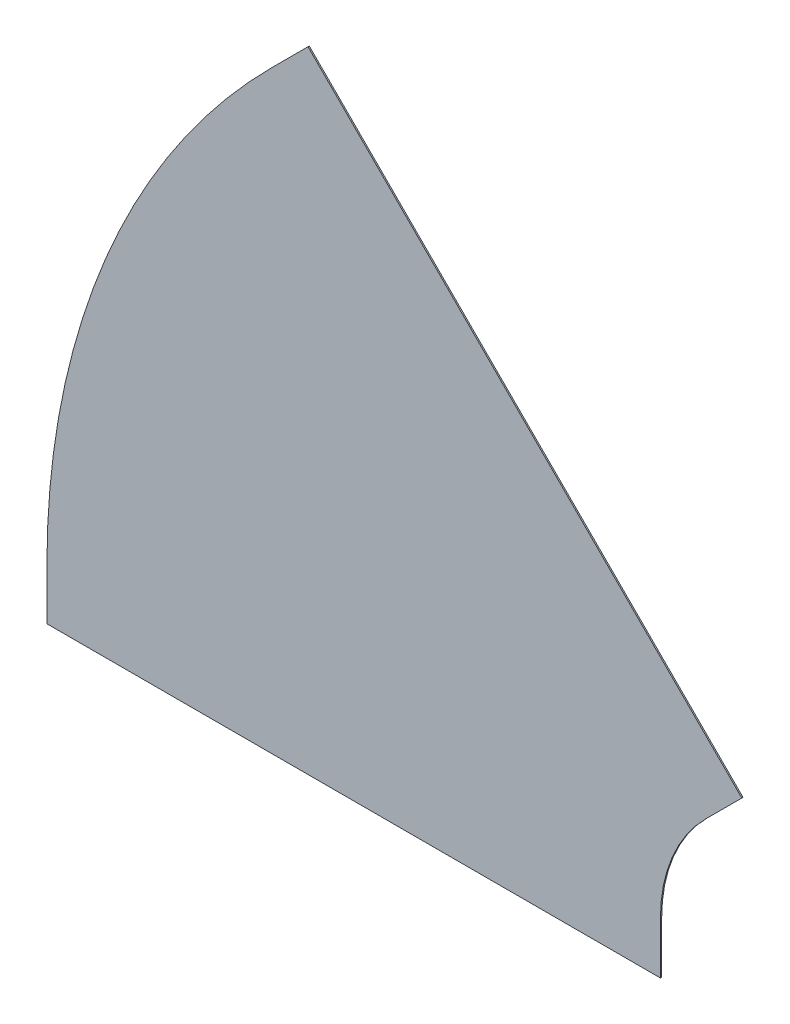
ISO-10303-21;
HEADER;
FILE_DESCRIPTION(('STEP AP214'),'2;1');
FILE_NAME('part.step','',(''),(''),'','','');
FILE_SCHEMA(('AUTOMOTIVE_DESIGN { 1 0 10303 214 1 1 1 1 }'));
ENDSEC;
DATA;
#1=APPLICATION_CONTEXT('core data for automotive mechanical design processes');
#2=APPLICATION_PROTOCOL_DEFINITION('international standard','automotive_design',2000,#1);
#3=PRODUCT_CONTEXT('',#1,'mechanical');
#4=PRODUCT('Part','Part','',(#3));
#5=PRODUCT_RELATED_PRODUCT_CATEGORY('part','',(#4));
#6=PRODUCT_DEFINITION_FORMATION('','',#4);
#7=PRODUCT_DEFINITION_CONTEXT('part definition',#1,'design');
#8=PRODUCT_DEFINITION('design','',#6,#7);
#9=PRODUCT_DEFINITION_SHAPE('','',#8);
#10=(LENGTH_UNIT() NAMED_UNIT(*) SI_UNIT(.MILLI.,.METRE.));
#11=(NAMED_UNIT(*) PLANE_ANGLE_UNIT() SI_UNIT($,.RADIAN.));
#12=(NAMED_UNIT(*) SI_UNIT($,.STERADIAN.) SOLID_ANGLE_UNIT());
#13=UNCERTAINTY_MEASURE_WITH_UNIT(LENGTH_MEASURE(1.E-05),#10,'distance_accuracy_value','');
#14=(GEOMETRIC_REPRESENTATION_CONTEXT(3) GLOBAL_UNCERTAINTY_ASSIGNED_CONTEXT((#13)) GLOBAL_UNIT_ASSIGNED_CONTEXT((#10,
#11,#12)) REPRESENTATION_CONTEXT('',''));
#15=CARTESIAN_POINT('',(0.,0.,0.));
#16=DIRECTION('',(0.,0.,1.));
#17=DIRECTION('',(1.,0.,0.));
#18=AXIS2_PLACEMENT_3D('',#15,#16,#17);
#19=CARTESIAN_POINT('',(0.,50.,1.21412));
#20=DIRECTION('',(1.,0.,0.));
#21=DIRECTION('',(0.,1.,0.));
#22=AXIS2_PLACEMENT_3D('',#19,#20,#21);
#23=PLANE('',#22);
#24=DIRECTION('',(0.,-1.,0.));
#25=VECTOR('',#24,1.);
#26=CARTESIAN_POINT('',(0.,50.,0.));
#27=LINE('',#26,#25);
#28=CARTESIAN_POINT('',(0.,50.0000000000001,0.));
#29=VERTEX_POINT('',#28);
#30=CARTESIAN_POINT('',(0.,0.,0.));
#31=VERTEX_POINT('',#30);
#32=EDGE_CURVE('E129',#29,#31,#27,.T.);
#33=ORIENTED_EDGE('',*,*,#32,.T.);
#34=DIRECTION('',(0.,0.,-1.));
#35=VECTOR('',#34,1.);
#36=CARTESIAN_POINT('',(0.,0.,1.21412));
#37=LINE('',#36,#35);
#38=CARTESIAN_POINT('',(0.,0.,1.21412));
#39=VERTEX_POINT('',#38);
#40=EDGE_CURVE('E11',#39,#31,#37,.T.);
#41=ORIENTED_EDGE('',*,*,#40,.F.);
#42=DIRECTION('',(0.,-1.,0.));
#43=VECTOR('',#42,1.);
#44=CARTESIAN_POINT('',(0.,50.,1.21412));
#45=LINE('',#44,#43);
#46=CARTESIAN_POINT('',(0.,50.0000000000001,1.21412));
#47=VERTEX_POINT('',#46);
#48=EDGE_CURVE('E143',#47,#39,#45,.T.);
#49=ORIENTED_EDGE('',*,*,#48,.F.);
#50=DIRECTION('',(0.,0.,-1.));
#51=VECTOR('',#50,1.);
#52=CARTESIAN_POINT('',(0.,50.0000000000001,1.21412));
#53=LINE('',#52,#51);
#54=EDGE_CURVE('E125',#47,#29,#53,.T.);
#55=ORIENTED_EDGE('',*,*,#54,.T.);
#56=EDGE_LOOP('',(#33,#41,#49,#55));
#57=FACE_BOUND('',#56,.T.);
#58=ADVANCED_FACE('F33',(#57),#23,.F.);
#59=CARTESIAN_POINT('',(0.,0.,1.21412));
#60=DIRECTION('',(0.,1.,0.));
#61=DIRECTION('',(0.,0.,1.));
#62=AXIS2_PLACEMENT_3D('',#59,#60,#61);
#63=PLANE('',#62);
#64=DIRECTION('',(1.,0.,0.));
#65=VECTOR('',#64,1.);
#66=CARTESIAN_POINT('',(0.,0.,0.));
#67=LINE('',#66,#65);
#68=CARTESIAN_POINT('',(597.572,0.,0.));
#69=VERTEX_POINT('',#68);
#70=EDGE_CURVE('E132',#31,#69,#67,.T.);
#71=ORIENTED_EDGE('',*,*,#70,.T.);
#72=DIRECTION('',(0.,0.,-1.));
#73=VECTOR('',#72,1.);
#74=CARTESIAN_POINT('',(597.572,0.,1.21412));
#75=LINE('',#74,#73);
#76=CARTESIAN_POINT('',(597.572,0.,1.21412));
#77=VERTEX_POINT('',#76);
#78=EDGE_CURVE('E41',#77,#69,#75,.T.);
#79=ORIENTED_EDGE('',*,*,#78,.F.);
#80=DIRECTION('',(1.,0.,0.));
#81=VECTOR('',#80,1.);
#82=CARTESIAN_POINT('',(0.,0.,1.21412));
#83=LINE('',#82,#81);
#84=EDGE_CURVE('E92',#39,#77,#83,.T.);
#85=ORIENTED_EDGE('',*,*,#84,.F.);
#86=ORIENTED_EDGE('',*,*,#40,.T.);
#87=EDGE_LOOP('',(#71,#79,#85,#86));
#88=FACE_BOUND('',#87,.T.);
#89=ADVANCED_FACE('F178',(#88),#63,.F.);
#90=CARTESIAN_POINT('',(597.572,0.,1.21412));
#91=DIRECTION('',(-1.,0.,0.));
#92=DIRECTION('',(0.,0.,1.));
#93=AXIS2_PLACEMENT_3D('',#90,#91,#92);
#94=PLANE('',#93);
#95=DIRECTION('',(0.,1.,0.));
#96=VECTOR('',#95,1.);
#97=CARTESIAN_POINT('',(597.572,0.,0.));
#98=LINE('',#97,#96);
#99=CARTESIAN_POINT('',(597.572,50.,0.));
#100=VERTEX_POINT('',#99);
#101=EDGE_CURVE('E134',#69,#100,#98,.T.);
#102=ORIENTED_EDGE('',*,*,#101,.T.);
#103=DIRECTION('',(0.,0.,-1.));
#104=VECTOR('',#103,1.);
#105=CARTESIAN_POINT('',(597.572,50.,1.21412));
#106=LINE('',#105,#104);
#107=CARTESIAN_POINT('',(597.572,50.,1.21412));
#108=VERTEX_POINT('',#107);
#109=EDGE_CURVE('E150',#108,#100,#106,.T.);
#110=ORIENTED_EDGE('',*,*,#109,.F.);
#111=DIRECTION('',(0.,1.,0.));
#112=VECTOR('',#111,1.);
#113=CARTESIAN_POINT('',(597.572,0.,1.21412));
#114=LINE('',#113,#112);
#115=EDGE_CURVE('E158',#77,#108,#114,.T.);
#116=ORIENTED_EDGE('',*,*,#115,.F.);
#117=ORIENTED_EDGE('',*,*,#78,.T.);
#118=EDGE_LOOP('',(#102,#110,#116,#117));
#119=FACE_BOUND('',#118,.T.);
#120=ADVANCED_FACE('F156',(#119),#94,.F.);
#121=CARTESIAN_POINT('',(747.572,50.,1.21412));
#122=DIRECTION('',(0.,0.,-1.));
#123=DIRECTION('',(-1.,0.,0.));
#124=AXIS2_PLACEMENT_3D('',#121,#122,#123);
#125=CYLINDRICAL_SURFACE('',#124,150.);
#126=CARTESIAN_POINT('',(747.572,50.,0.));
#127=DIRECTION('',(0.,0.,-1.));
#128=DIRECTION('',(-1.,0.,0.));
#129=AXIS2_PLACEMENT_3D('',#126,#127,#128);
#130=CIRCLE('',#129,150.);
#131=CARTESIAN_POINT('',(641.505982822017,156.066017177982,0.));
#132=VERTEX_POINT('',#131);
#133=EDGE_CURVE('E136',#100,#132,#130,.T.);
#134=ORIENTED_EDGE('',*,*,#133,.T.);
#135=DIRECTION('',(0.,0.,-1.));
#136=VECTOR('',#135,1.);
#137=CARTESIAN_POINT('',(641.505982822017,156.066017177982,1.21412));
#138=LINE('',#137,#136);
#139=CARTESIAN_POINT('',(641.505982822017,156.066017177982,1.21412));
#140=VERTEX_POINT('',#139);
#141=EDGE_CURVE('E147',#140,#132,#138,.T.);
#142=ORIENTED_EDGE('',*,*,#141,.F.);
#143=CARTESIAN_POINT('',(747.572,50.,1.21412));
#144=DIRECTION('',(0.,0.,-1.));
#145=DIRECTION('',(-1.,0.,0.));
#146=AXIS2_PLACEMENT_3D('',#143,#144,#145);
#147=CIRCLE('',#146,150.);
#148=EDGE_CURVE('E170',#108,#140,#147,.T.);
#149=ORIENTED_EDGE('',*,*,#148,.F.);
#150=ORIENTED_EDGE('',*,*,#109,.T.);
#151=EDGE_LOOP('',(#134,#142,#149,#150));
#152=FACE_BOUND('',#151,.T.);
#153=ADVANCED_FACE('F166',(#152),#125,.F.);
#154=CARTESIAN_POINT('',(641.505982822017,156.066017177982,1.21412));
#155=DIRECTION('',(-0.707106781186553,0.707106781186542,0.));
#156=DIRECTION('',(-0.707106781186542,-0.707106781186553,0.));
#157=AXIS2_PLACEMENT_3D('',#154,#155,#156);
#158=PLANE('',#157);
#159=DIRECTION('',(0.707106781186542,0.707106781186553,0.));
#160=VECTOR('',#159,1.);
#161=CARTESIAN_POINT('',(641.505982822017,156.066017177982,0.));
#162=LINE('',#161,#160);
#163=CARTESIAN_POINT('',(676.861321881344,191.421356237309,0.));
#164=VERTEX_POINT('',#163);
#165=EDGE_CURVE('E138',#132,#164,#162,.T.);
#166=ORIENTED_EDGE('',*,*,#165,.T.);
#167=DIRECTION('',(0.,0.,-1.));
#168=VECTOR('',#167,1.);
#169=CARTESIAN_POINT('',(676.861321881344,191.421356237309,1.21412));
#170=LINE('',#169,#168);
#171=CARTESIAN_POINT('',(676.861321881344,191.421356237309,1.21412));
#172=VERTEX_POINT('',#171);
#173=EDGE_CURVE('E120',#172,#164,#170,.T.);
#174=ORIENTED_EDGE('',*,*,#173,.F.);
#175=DIRECTION('',(0.707106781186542,0.707106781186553,0.));
#176=VECTOR('',#175,1.);
#177=CARTESIAN_POINT('',(641.505982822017,156.066017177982,1.21412));
#178=LINE('',#177,#176);
#179=EDGE_CURVE('E111',#140,#172,#178,.T.);
#180=ORIENTED_EDGE('',*,*,#179,.F.);
#181=ORIENTED_EDGE('',*,*,#141,.T.);
#182=EDGE_LOOP('',(#166,#174,#180,#181));
#183=FACE_BOUND('',#182,.T.);
#184=ADVANCED_FACE('F169',(#183),#158,.F.);
#185=CARTESIAN_POINT('',(676.861321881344,191.421356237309,1.21412));
#186=DIRECTION('',(-0.707106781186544,-0.707106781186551,0.));
#187=DIRECTION('',(0.707106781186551,-0.707106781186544,0.));
#188=AXIS2_PLACEMENT_3D('',#185,#186,#187);
#189=PLANE('',#188);
#190=DIRECTION('',(-0.707106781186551,0.707106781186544,0.));
#191=VECTOR('',#190,1.);
#192=CARTESIAN_POINT('',(676.861321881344,191.421356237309,0.));
#193=LINE('',#192,#191);
#194=CARTESIAN_POINT('',(254.314108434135,613.968569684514,0.));
#195=VERTEX_POINT('',#194);
#196=EDGE_CURVE('E119',#164,#195,#193,.T.);
#197=ORIENTED_EDGE('',*,*,#196,.T.);
#198=DIRECTION('',(0.,0.,-1.));
#199=VECTOR('',#198,1.);
#200=CARTESIAN_POINT('',(254.314108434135,613.968569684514,1.21412));
#201=LINE('',#200,#199);
#202=CARTESIAN_POINT('',(254.314108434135,613.968569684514,1.21412));
#203=VERTEX_POINT('',#202);
#204=EDGE_CURVE('E116',#203,#195,#201,.T.);
#205=ORIENTED_EDGE('',*,*,#204,.F.);
#206=DIRECTION('',(-0.707106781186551,0.707106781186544,0.));
#207=VECTOR('',#206,1.);
#208=CARTESIAN_POINT('',(676.861321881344,191.421356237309,1.21412));
#209=LINE('',#208,#207);
#210=EDGE_CURVE('E105',#172,#203,#209,.T.);
#211=ORIENTED_EDGE('',*,*,#210,.F.);
#212=ORIENTED_EDGE('',*,*,#173,.T.);
#213=EDGE_LOOP('',(#197,#205,#211,#212));
#214=FACE_BOUND('',#213,.T.);
#215=ADVANCED_FACE('F117',(#214),#189,.F.);
#216=CARTESIAN_POINT('',(254.314108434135,613.968569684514,1.21412));
#217=DIRECTION('',(0.707106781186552,-0.707106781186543,0.));
#218=DIRECTION('',(0.707106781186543,0.707106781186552,0.));
#219=AXIS2_PLACEMENT_3D('',#216,#217,#218);
#220=PLANE('',#219);
#221=DIRECTION('',(-0.707106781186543,-0.707106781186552,0.));
#222=VECTOR('',#221,1.);
#223=CARTESIAN_POINT('',(254.314108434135,613.968569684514,0.));
#224=LINE('',#223,#222);
#225=CARTESIAN_POINT('',(218.958769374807,578.613230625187,0.));
#226=VERTEX_POINT('',#225);
#227=EDGE_CURVE('E78',#195,#226,#224,.T.);
#228=ORIENTED_EDGE('',*,*,#227,.T.);
#229=DIRECTION('',(0.,0.,-1.));
#230=VECTOR('',#229,1.);
#231=CARTESIAN_POINT('',(218.958769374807,578.613230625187,1.21412));
#232=LINE('',#231,#230);
#233=CARTESIAN_POINT('',(218.958769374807,578.613230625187,1.21412));
#234=VERTEX_POINT('',#233);
#235=EDGE_CURVE('E121',#234,#226,#232,.T.);
#236=ORIENTED_EDGE('',*,*,#235,.F.);
#237=DIRECTION('',(-0.707106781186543,-0.707106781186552,0.));
#238=VECTOR('',#237,1.);
#239=CARTESIAN_POINT('',(254.314108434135,613.968569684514,1.21412));
#240=LINE('',#239,#238);
#241=EDGE_CURVE('E109',#203,#234,#240,.T.);
#242=ORIENTED_EDGE('',*,*,#241,.F.);
#243=ORIENTED_EDGE('',*,*,#204,.T.);
#244=EDGE_LOOP('',(#228,#236,#242,#243));
#245=FACE_BOUND('',#244,.T.);
#246=ADVANCED_FACE('F123',(#245),#220,.F.);
#247=CARTESIAN_POINT('',(747.572000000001,49.9999999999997,1.21412));
#248=DIRECTION('',(0.,0.,-1.));
#249=DIRECTION('',(-1.,0.,0.));
#250=AXIS2_PLACEMENT_3D('',#247,#248,#249);
#251=CYLINDRICAL_SURFACE('',#250,747.572000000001);
#252=CARTESIAN_POINT('',(747.572000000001,49.9999999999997,0.));
#253=DIRECTION('',(0.,0.,1.));
#254=DIRECTION('',(1.,0.,0.));
#255=AXIS2_PLACEMENT_3D('',#252,#253,#254);
#256=CIRCLE('',#255,747.572000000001);
#257=EDGE_CURVE('E84',#226,#29,#256,.T.);
#258=ORIENTED_EDGE('',*,*,#257,.T.);
#259=ORIENTED_EDGE('',*,*,#54,.F.);
#260=CARTESIAN_POINT('',(747.572000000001,49.9999999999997,1.21412));
#261=DIRECTION('',(0.,0.,1.));
#262=DIRECTION('',(1.,0.,0.));
#263=AXIS2_PLACEMENT_3D('',#260,#261,#262);
#264=CIRCLE('',#263,747.572000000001);
#265=EDGE_CURVE('E49',#234,#47,#264,.T.);
#266=ORIENTED_EDGE('',*,*,#265,.F.);
#267=ORIENTED_EDGE('',*,*,#235,.T.);
#268=EDGE_LOOP('',(#258,#259,#266,#267));
#269=FACE_BOUND('',#268,.T.);
#270=ADVANCED_FACE('F194',(#269),#251,.T.);
#271=CARTESIAN_POINT('',(747.572,50.,1.21412));
#272=DIRECTION('',(0.,0.,-1.));
#273=DIRECTION('',(-1.,0.,0.));
#274=AXIS2_PLACEMENT_3D('',#271,#272,#273);
#275=PLANE('',#274);
#276=ORIENTED_EDGE('',*,*,#48,.T.);
#277=ORIENTED_EDGE('',*,*,#84,.T.);
#278=ORIENTED_EDGE('',*,*,#115,.T.);
#279=ORIENTED_EDGE('',*,*,#148,.T.);
#280=ORIENTED_EDGE('',*,*,#179,.T.);
#281=ORIENTED_EDGE('',*,*,#210,.T.);
#282=ORIENTED_EDGE('',*,*,#241,.T.);
#283=ORIENTED_EDGE('',*,*,#265,.T.);
#284=EDGE_LOOP('',(#276,#277,#278,#279,#280,#281,#282,#283));
#285=FACE_BOUND('',#284,.T.);
#286=ADVANCED_FACE('F107',(#285),#275,.F.);
#287=CARTESIAN_POINT('',(747.572,50.,0.));
#288=DIRECTION('',(0.,0.,-1.));
#289=DIRECTION('',(-1.,0.,0.));
#290=AXIS2_PLACEMENT_3D('',#287,#288,#289);
#291=PLANE('',#290);
#292=ORIENTED_EDGE('',*,*,#32,.F.);
#293=ORIENTED_EDGE('',*,*,#257,.F.);
#294=ORIENTED_EDGE('',*,*,#227,.F.);
#295=ORIENTED_EDGE('',*,*,#196,.F.);
#296=ORIENTED_EDGE('',*,*,#165,.F.);
#297=ORIENTED_EDGE('',*,*,#133,.F.);
#298=ORIENTED_EDGE('',*,*,#101,.F.);
#299=ORIENTED_EDGE('',*,*,#70,.F.);
#300=EDGE_LOOP('',(#292,#293,#294,#295,#296,#297,#298,#299));
#301=FACE_BOUND('',#300,.T.);
#302=ADVANCED_FACE('F162',(#301),#291,.T.);
#303=CLOSED_SHELL('',(#58,#89,#120,#153,#184,#215,#246,#270,#286,#302));
#304=MANIFOLD_SOLID_BREP('B2',#303);
#305=ADVANCED_BREP_SHAPE_REPRESENTATION('',(#18,#304),#14);
#306=SHAPE_DEFINITION_REPRESENTATION(#9,#305);
ENDSEC;
END-ISO-10303-21;
